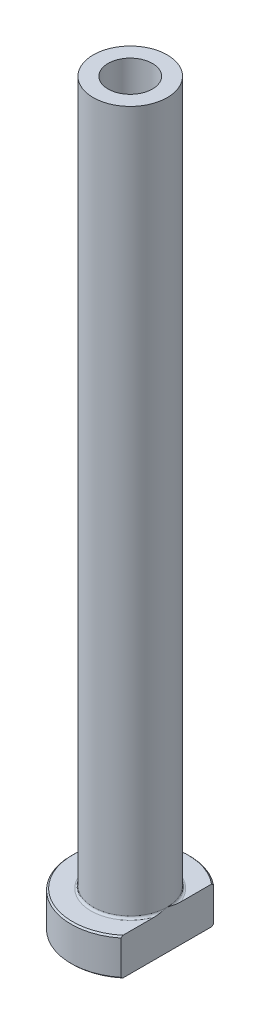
ISO-10303-21;
HEADER;
FILE_DESCRIPTION(('STEP AP214'),'2;1');
FILE_NAME('part.step','',(''),(''),'','','');
FILE_SCHEMA(('AUTOMOTIVE_DESIGN { 1 0 10303 214 1 1 1 1 }'));
ENDSEC;
DATA;
#1=APPLICATION_CONTEXT('core data for automotive mechanical design processes');
#2=APPLICATION_PROTOCOL_DEFINITION('international standard','automotive_design',2000,#1);
#3=PRODUCT_CONTEXT('',#1,'mechanical');
#4=PRODUCT('Part','Part','',(#3));
#5=PRODUCT_RELATED_PRODUCT_CATEGORY('part','',(#4));
#6=PRODUCT_DEFINITION_FORMATION('','',#4);
#7=PRODUCT_DEFINITION_CONTEXT('part definition',#1,'design');
#8=PRODUCT_DEFINITION('design','',#6,#7);
#9=PRODUCT_DEFINITION_SHAPE('','',#8);
#10=(LENGTH_UNIT() NAMED_UNIT(*) SI_UNIT(.MILLI.,.METRE.));
#11=(NAMED_UNIT(*) PLANE_ANGLE_UNIT() SI_UNIT($,.RADIAN.));
#12=(NAMED_UNIT(*) SI_UNIT($,.STERADIAN.) SOLID_ANGLE_UNIT());
#13=UNCERTAINTY_MEASURE_WITH_UNIT(LENGTH_MEASURE(1.E-05),#10,'distance_accuracy_value','');
#14=(GEOMETRIC_REPRESENTATION_CONTEXT(3) GLOBAL_UNCERTAINTY_ASSIGNED_CONTEXT((#13)) GLOBAL_UNIT_ASSIGNED_CONTEXT((#10,
#11,#12)) REPRESENTATION_CONTEXT('',''));
#15=CARTESIAN_POINT('',(0.,0.,0.));
#16=DIRECTION('',(0.,0.,1.));
#17=DIRECTION('',(1.,0.,0.));
#18=AXIS2_PLACEMENT_3D('',#15,#16,#17);
#19=CARTESIAN_POINT('',(0.,92.1876809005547,0.));
#20=DIRECTION('',(0.,1.,0.));
#21=DIRECTION('',(0.,0.,1.));
#22=AXIS2_PLACEMENT_3D('',#19,#20,#21);
#23=CYLINDRICAL_SURFACE('',#22,2.99999999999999);
#24=CARTESIAN_POINT('',(0.,100.,0.));
#25=DIRECTION('',(0.,1.,0.));
#26=DIRECTION('',(0.,0.,1.));
#27=AXIS2_PLACEMENT_3D('',#24,#25,#26);
#28=CIRCLE('',#27,2.99999999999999);
#29=CARTESIAN_POINT('',(0.,100.,2.99999999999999));
#30=VERTEX_POINT('',#29);
#31=EDGE_CURVE('E167',#30,#30,#28,.T.);
#32=ORIENTED_EDGE('',*,*,#31,.T.);
#33=EDGE_LOOP('',(#32));
#34=FACE_BOUND('',#33,.T.);
#35=CARTESIAN_POINT('',(0.,55.,0.));
#36=DIRECTION('',(0.,1.,0.));
#37=DIRECTION('',(0.,0.,1.));
#38=AXIS2_PLACEMENT_3D('',#35,#36,#37);
#39=CIRCLE('',#38,2.99999999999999);
#40=CARTESIAN_POINT('',(0.,55.,2.99999999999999));
#41=VERTEX_POINT('',#40);
#42=EDGE_CURVE('E170',#41,#41,#39,.T.);
#43=ORIENTED_EDGE('',*,*,#42,.F.);
#44=EDGE_LOOP('',(#43));
#45=FACE_BOUND('',#44,.T.);
#46=ADVANCED_FACE('F32',(#34,#45),#23,.F.);
#47=CARTESIAN_POINT('',(-2.99999999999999,100.,0.));
#48=DIRECTION('',(0.,1.,0.));
#49=DIRECTION('',(0.,0.,1.));
#50=AXIS2_PLACEMENT_3D('',#47,#48,#49);
#51=PLANE('',#50);
#52=CARTESIAN_POINT('',(0.,100.,0.));
#53=DIRECTION('',(0.,1.,0.));
#54=DIRECTION('',(0.,0.,1.));
#55=AXIS2_PLACEMENT_3D('',#52,#53,#54);
#56=CIRCLE('',#55,5.);
#57=CARTESIAN_POINT('',(0.,100.,5.));
#58=VERTEX_POINT('',#57);
#59=EDGE_CURVE('E174',#58,#58,#56,.T.);
#60=ORIENTED_EDGE('',*,*,#59,.T.);
#61=EDGE_LOOP('',(#60));
#62=FACE_BOUND('',#61,.T.);
#63=ORIENTED_EDGE('',*,*,#31,.F.);
#64=EDGE_LOOP('',(#63));
#65=FACE_BOUND('',#64,.T.);
#66=ADVANCED_FACE('F157',(#62,#65),#51,.T.);
#67=CARTESIAN_POINT('',(0.,92.1876809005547,0.));
#68=DIRECTION('',(0.,1.,0.));
#69=DIRECTION('',(0.,0.,1.));
#70=AXIS2_PLACEMENT_3D('',#67,#68,#69);
#71=CYLINDRICAL_SURFACE('',#70,5.);
#72=CARTESIAN_POINT('',(0.,5.3,0.));
#73=DIRECTION('',(0.,1.,0.));
#74=DIRECTION('',(0.,0.,1.));
#75=AXIS2_PLACEMENT_3D('',#72,#73,#74);
#76=CIRCLE('',#75,5.);
#77=CARTESIAN_POINT('',(5.,5.3,0.));
#78=VERTEX_POINT('',#77);
#79=EDGE_CURVE('E180',#78,#78,#76,.T.);
#80=ORIENTED_EDGE('',*,*,#79,.T.);
#81=EDGE_LOOP('',(#80));
#82=FACE_BOUND('',#81,.T.);
#83=ORIENTED_EDGE('',*,*,#59,.F.);
#84=EDGE_LOOP('',(#83));
#85=FACE_BOUND('',#84,.T.);
#86=ADVANCED_FACE('F162',(#82,#85),#71,.T.);
#87=CARTESIAN_POINT('',(-4.99999999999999,5.,0.));
#88=DIRECTION('',(0.,1.,0.));
#89=DIRECTION('',(0.,0.,1.));
#90=AXIS2_PLACEMENT_3D('',#87,#88,#89);
#91=PLANE('',#90);
#92=DIRECTION('',(0.,0.,1.));
#93=VECTOR('',#92,1.);
#94=CARTESIAN_POINT('',(5.,5.,0.));
#95=LINE('',#94,#93);
#96=CARTESIAN_POINT('',(5.,5.,-5.98665181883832));
#97=VERTEX_POINT('',#96);
#98=CARTESIAN_POINT('',(5.,5.,-1.75783958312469));
#99=VERTEX_POINT('',#98);
#100=EDGE_CURVE('E54',#97,#99,#95,.T.);
#101=ORIENTED_EDGE('',*,*,#100,.F.);
#102=CARTESIAN_POINT('',(0.,5.,0.));
#103=DIRECTION('',(0.,1.,0.));
#104=DIRECTION('',(0.,0.,1.));
#105=AXIS2_PLACEMENT_3D('',#102,#103,#104);
#106=CIRCLE('',#105,7.80000000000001);
#107=CARTESIAN_POINT('',(4.99999999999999,5.,5.98665181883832));
#108=VERTEX_POINT('',#107);
#109=EDGE_CURVE('E186',#97,#108,#106,.T.);
#110=ORIENTED_EDGE('',*,*,#109,.T.);
#111=CARTESIAN_POINT('',(5.,5.,1.75783958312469));
#112=VERTEX_POINT('',#111);
#113=EDGE_CURVE('E134',#112,#108,#95,.T.);
#114=ORIENTED_EDGE('',*,*,#113,.F.);
#115=CARTESIAN_POINT('',(0.,5.,0.));
#116=DIRECTION('',(0.,1.,0.));
#117=DIRECTION('',(0.,0.,1.));
#118=AXIS2_PLACEMENT_3D('',#115,#116,#117);
#119=CIRCLE('',#118,5.3);
#120=EDGE_CURVE('E183',#112,#99,#119,.F.);
#121=ORIENTED_EDGE('',*,*,#120,.T.);
#122=EDGE_LOOP('',(#101,#110,#114,#121));
#123=FACE_BOUND('',#122,.T.);
#124=ADVANCED_FACE('F197',(#123),#91,.T.);
#125=CARTESIAN_POINT('',(0.,92.1876809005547,0.));
#126=DIRECTION('',(0.,1.,0.));
#127=DIRECTION('',(0.,0.,1.));
#128=AXIS2_PLACEMENT_3D('',#125,#126,#127);
#129=CYLINDRICAL_SURFACE('',#128,7.99999999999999);
#130=DIRECTION('',(0.,-1.,0.));
#131=VECTOR('',#130,1.);
#132=CARTESIAN_POINT('',(4.99999999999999,100.,6.24499799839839));
#133=LINE('',#132,#131);
#134=CARTESIAN_POINT('',(4.99999999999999,4.80000000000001,6.24499799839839));
#135=VERTEX_POINT('',#134);
#136=CARTESIAN_POINT('',(4.99999999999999,0.200000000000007,6.24499799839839));
#137=VERTEX_POINT('',#136);
#138=EDGE_CURVE('E82',#135,#137,#133,.T.);
#139=ORIENTED_EDGE('',*,*,#138,.F.);
#140=CARTESIAN_POINT('',(0.,4.80000000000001,0.));
#141=DIRECTION('',(0.,1.,0.));
#142=DIRECTION('',(0.,0.,1.));
#143=AXIS2_PLACEMENT_3D('',#140,#141,#142);
#144=CIRCLE('',#143,7.99999999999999);
#145=CARTESIAN_POINT('',(5.,4.80000000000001,-6.24499799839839));
#146=VERTEX_POINT('',#145);
#147=EDGE_CURVE('E95',#135,#146,#144,.F.);
#148=ORIENTED_EDGE('',*,*,#147,.T.);
#149=DIRECTION('',(0.,-1.,0.));
#150=VECTOR('',#149,1.);
#151=CARTESIAN_POINT('',(5.,100.,-6.24499799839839));
#152=LINE('',#151,#150);
#153=CARTESIAN_POINT('',(5.,0.200000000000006,-6.24499799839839));
#154=VERTEX_POINT('',#153);
#155=EDGE_CURVE('E192',#146,#154,#152,.T.);
#156=ORIENTED_EDGE('',*,*,#155,.T.);
#157=CARTESIAN_POINT('',(0.,0.200000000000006,0.));
#158=DIRECTION('',(0.,-1.,0.));
#159=DIRECTION('',(0.,0.,-1.));
#160=AXIS2_PLACEMENT_3D('',#157,#158,#159);
#161=CIRCLE('',#160,7.99999999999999);
#162=EDGE_CURVE('E98',#154,#137,#161,.F.);
#163=ORIENTED_EDGE('',*,*,#162,.T.);
#164=EDGE_LOOP('',(#139,#148,#156,#163));
#165=FACE_BOUND('',#164,.T.);
#166=ADVANCED_FACE('F190',(#165),#129,.T.);
#167=CARTESIAN_POINT('',(-7.99999999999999,0.,0.));
#168=DIRECTION('',(0.,-1.,0.));
#169=DIRECTION('',(0.,0.,-1.));
#170=AXIS2_PLACEMENT_3D('',#167,#168,#169);
#171=PLANE('',#170);
#172=CARTESIAN_POINT('',(0.,0.,0.));
#173=DIRECTION('',(0.,-1.,0.));
#174=DIRECTION('',(0.,0.,-1.));
#175=AXIS2_PLACEMENT_3D('',#172,#173,#174);
#176=CIRCLE('',#175,3.74999999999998);
#177=CARTESIAN_POINT('',(0.,0.,-3.74999999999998));
#178=VERTEX_POINT('',#177);
#179=EDGE_CURVE('E40',#178,#178,#176,.F.);
#180=ORIENTED_EDGE('',*,*,#179,.T.);
#181=EDGE_LOOP('',(#180));
#182=FACE_BOUND('',#181,.T.);
#183=DIRECTION('',(0.,0.,-1.));
#184=VECTOR('',#183,1.);
#185=CARTESIAN_POINT('',(4.99999999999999,0.,6.24499799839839));
#186=LINE('',#185,#184);
#187=CARTESIAN_POINT('',(4.99999999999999,0.,5.9866518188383));
#188=VERTEX_POINT('',#187);
#189=CARTESIAN_POINT('',(5.,0.,-5.98665181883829));
#190=VERTEX_POINT('',#189);
#191=EDGE_CURVE('E47',#188,#190,#186,.T.);
#192=ORIENTED_EDGE('',*,*,#191,.F.);
#193=CARTESIAN_POINT('',(0.,0.,0.));
#194=DIRECTION('',(0.,-1.,0.));
#195=DIRECTION('',(0.,0.,-1.));
#196=AXIS2_PLACEMENT_3D('',#193,#194,#195);
#197=CIRCLE('',#196,7.79999999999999);
#198=EDGE_CURVE('E92',#188,#190,#197,.T.);
#199=ORIENTED_EDGE('',*,*,#198,.T.);
#200=EDGE_LOOP('',(#192,#199));
#201=FACE_BOUND('',#200,.T.);
#202=ADVANCED_FACE('F91',(#182,#201),#171,.T.);
#203=CARTESIAN_POINT('',(0.,92.1876809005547,0.));
#204=DIRECTION('',(0.,1.,0.));
#205=DIRECTION('',(0.,0.,1.));
#206=AXIS2_PLACEMENT_3D('',#203,#204,#205);
#207=CYLINDRICAL_SURFACE('',#206,3.24999999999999);
#208=CARTESIAN_POINT('',(0.,0.499999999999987,0.));
#209=DIRECTION('',(0.,-1.,0.));
#210=DIRECTION('',(0.,0.,-1.));
#211=AXIS2_PLACEMENT_3D('',#208,#209,#210);
#212=CIRCLE('',#211,3.24999999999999);
#213=CARTESIAN_POINT('',(0.,0.499999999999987,-3.24999999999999));
#214=VERTEX_POINT('',#213);
#215=EDGE_CURVE('E11',#214,#214,#212,.T.);
#216=ORIENTED_EDGE('',*,*,#215,.T.);
#217=EDGE_LOOP('',(#216));
#218=FACE_BOUND('',#217,.T.);
#219=CARTESIAN_POINT('',(0.,43.,0.));
#220=DIRECTION('',(0.,1.,0.));
#221=DIRECTION('',(0.,0.,1.));
#222=AXIS2_PLACEMENT_3D('',#219,#220,#221);
#223=CIRCLE('',#222,3.25);
#224=CARTESIAN_POINT('',(0.,43.,3.25));
#225=VERTEX_POINT('',#224);
#226=EDGE_CURVE('E172',#225,#225,#223,.T.);
#227=ORIENTED_EDGE('',*,*,#226,.T.);
#228=EDGE_LOOP('',(#227));
#229=FACE_BOUND('',#228,.T.);
#230=ADVANCED_FACE('F215',(#218,#229),#207,.F.);
#231=CARTESIAN_POINT('',(0.,43.,0.));
#232=DIRECTION('',(0.,-1.,0.));
#233=DIRECTION('',(0.,0.,-1.));
#234=AXIS2_PLACEMENT_3D('',#231,#232,#233);
#235=CONICAL_SURFACE('',#234,3.25,0.0208303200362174);
#236=ORIENTED_EDGE('',*,*,#42,.T.);
#237=EDGE_LOOP('',(#236));
#238=FACE_BOUND('',#237,.T.);
#239=ORIENTED_EDGE('',*,*,#226,.F.);
#240=EDGE_LOOP('',(#239));
#241=FACE_BOUND('',#240,.T.);
#242=ADVANCED_FACE('F111',(#238,#241),#235,.F.);
#243=CARTESIAN_POINT('',(0.,5.3,0.));
#244=DIRECTION('',(0.,1.,0.));
#245=DIRECTION('',(0.,0.,1.));
#246=AXIS2_PLACEMENT_3D('',#243,#244,#245);
#247=TOROIDAL_SURFACE('',#246,5.3,0.3);
#248=ORIENTED_EDGE('',*,*,#120,.F.);
#249=CARTESIAN_POINT('',(5.,5.3,0.));
#250=CARTESIAN_POINT('',(5.,5.30000062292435,-1.31469035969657E-10));
#251=CARTESIAN_POINT('',(5.,5.30000124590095,2.52759224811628E-07));
#252=CARTESIAN_POINT('',(5.,5.30000240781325,9.47164356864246E-07));
#253=CARTESIAN_POINT('',(5.,5.30000293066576,1.40594039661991E-06));
#254=CARTESIAN_POINT('',(5.,5.30000402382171,2.50637608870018E-06));
#255=CARTESIAN_POINT('',(5.,5.30000457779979,3.1658891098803E-06));
#256=CARTESIAN_POINT('',(5.,5.30000556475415,4.52859968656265E-06));
#257=CARTESIAN_POINT('',(5.,5.30000600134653,5.22939450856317E-06));
#258=CARTESIAN_POINT('',(5.,5.30000763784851,7.96121989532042E-06));
#259=CARTESIAN_POINT('',(5.,5.30000875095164,1.00477409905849E-05));
#260=CARTESIAN_POINT('',(5.,5.30001056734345,1.41660874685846E-05));
#261=CARTESIAN_POINT('',(5.,5.30001129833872,1.61861784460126E-05));
#262=CARTESIAN_POINT('',(5.,5.3000143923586,2.47865742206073E-05));
#263=CARTESIAN_POINT('',(5.,5.30001672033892,3.13830284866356E-05));
#264=CARTESIAN_POINT('',(5.,5.3000201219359,4.38084221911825E-05));
#265=CARTESIAN_POINT('',(5.,5.30002133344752,4.95992740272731E-05));
#266=CARTESIAN_POINT('',(5.,5.30003020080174,9.27862615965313E-05));
#267=CARTESIAN_POINT('',(5.,5.30003696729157,0.000130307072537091));
#268=CARTESIAN_POINT('',(5.,5.30006659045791,0.000278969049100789));
#269=CARTESIAN_POINT('',(5.,5.30009481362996,0.000389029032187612));
#270=CARTESIAN_POINT('',(5.,5.30020506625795,0.000826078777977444));
#271=CARTESIAN_POINT('',(5.,5.30028365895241,0.00115365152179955));
#272=CARTESIAN_POINT('',(5.,5.30059919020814,0.00245925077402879));
#273=CARTESIAN_POINT('',(5.,5.3008404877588,0.00343651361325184));
#274=CARTESIAN_POINT('',(5.,5.30184626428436,0.00752058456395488));
#275=CARTESIAN_POINT('',(5.,5.30260525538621,0.0106283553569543));
#276=CARTESIAN_POINT('',(5.,5.30996461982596,0.0407482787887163));
#277=CARTESIAN_POINT('',(5.,5.3165898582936,0.0677561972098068));
#278=CARTESIAN_POINT('',(5.,5.32953319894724,0.120688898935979));
#279=CARTESIAN_POINT('',(5.,5.33585289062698,0.146613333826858));
#280=CARTESIAN_POINT('',(5.,5.34926050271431,0.201795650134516));
#281=CARTESIAN_POINT('',(5.,5.35634306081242,0.231054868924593));
#282=CARTESIAN_POINT('',(5.,5.37050252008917,0.289917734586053));
#283=CARTESIAN_POINT('',(5.,5.37757848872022,0.319521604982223));
#284=CARTESIAN_POINT('',(5.,5.39452602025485,0.391032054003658));
#285=CARTESIAN_POINT('',(5.,5.40434071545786,0.432952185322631));
#286=CARTESIAN_POINT('',(5.,5.42340141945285,0.515763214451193));
#287=CARTESIAN_POINT('',(5.,5.4326555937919,0.556652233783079));
#288=CARTESIAN_POINT('',(5.,5.4571055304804,0.667075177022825));
#289=CARTESIAN_POINT('',(5.,5.47194176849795,0.736689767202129));
#290=CARTESIAN_POINT('',(5.,5.50018229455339,0.876836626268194));
#291=CARTESIAN_POINT('',(5.,5.51357312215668,0.947371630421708));
#292=CARTESIAN_POINT('',(5.,5.5393092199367,1.09497328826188));
#293=CARTESIAN_POINT('',(5.,5.5514621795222,1.17207432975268));
#294=CARTESIAN_POINT('',(5.,5.57239669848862,1.32672649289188));
#295=CARTESIAN_POINT('',(5.,5.58117877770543,1.40427754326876));
#296=CARTESIAN_POINT('',(5.,5.59499725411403,1.56873827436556));
#297=CARTESIAN_POINT('',(5.,5.59948802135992,1.65570044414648));
#298=CARTESIAN_POINT('',(5.,5.60018885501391,1.78535304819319));
#299=CARTESIAN_POINT('',(5.,5.59945214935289,1.82802575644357));
#300=CARTESIAN_POINT('',(5.,5.59559364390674,1.91325081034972));
#301=CARTESIAN_POINT('',(5.,5.59247319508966,1.95580321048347));
#302=CARTESIAN_POINT('',(5.,5.58383242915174,2.03512365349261));
#303=CARTESIAN_POINT('',(5.,5.57867386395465,2.07192937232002));
#304=CARTESIAN_POINT('',(5.,5.56543793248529,2.14526756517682));
#305=CARTESIAN_POINT('',(5.,5.55734203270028,2.18179676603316));
#306=CARTESIAN_POINT('',(5.,5.53718005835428,2.25427226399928));
#307=CARTESIAN_POINT('',(5.,5.52507057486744,2.29020746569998));
#308=CARTESIAN_POINT('',(5.,5.50270928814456,2.34223029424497));
#309=CARTESIAN_POINT('',(5.,5.4945781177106,2.35922314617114));
#310=CARTESIAN_POINT('',(5.,5.47657809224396,2.39224900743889));
#311=CARTESIAN_POINT('',(5.,5.46671281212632,2.40828390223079));
#312=CARTESIAN_POINT('',(5.,5.446958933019,2.43579467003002));
#313=CARTESIAN_POINT('',(5.,5.43745879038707,2.4475459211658));
#314=CARTESIAN_POINT('',(5.,5.41677914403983,2.46946476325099));
#315=CARTESIAN_POINT('',(5.,5.40560543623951,2.47963758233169));
#316=CARTESIAN_POINT('',(5.,5.38617750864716,2.49393642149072));
#317=CARTESIAN_POINT('',(5.,5.37851643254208,2.49886271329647));
#318=CARTESIAN_POINT('',(5.,5.36252740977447,2.50749953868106));
#319=CARTESIAN_POINT('',(5.,5.35419984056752,2.51121075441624));
#320=CARTESIAN_POINT('',(5.,5.33690648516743,2.51712941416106));
#321=CARTESIAN_POINT('',(5.,5.32793451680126,2.5193192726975));
#322=CARTESIAN_POINT('',(5.,5.30973576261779,2.52185978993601));
#323=CARTESIAN_POINT('',(5.,5.30050931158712,2.52221275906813));
#324=CARTESIAN_POINT('',(5.,5.28349166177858,2.52112455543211));
#325=CARTESIAN_POINT('',(5.,5.27568322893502,2.51993178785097));
#326=CARTESIAN_POINT('',(5.,5.26036860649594,2.51628294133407));
#327=CARTESIAN_POINT('',(5.,5.25286261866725,2.5138260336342));
#328=CARTESIAN_POINT('',(5.,5.23590266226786,2.50685484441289));
#329=CARTESIAN_POINT('',(5.,5.22661875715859,2.5019298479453));
#330=CARTESIAN_POINT('',(5.,5.2089551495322,2.49066548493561));
#331=CARTESIAN_POINT('',(5.,5.20057756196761,2.4843229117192));
#332=CARTESIAN_POINT('',(5.,5.17987008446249,2.46645212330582));
#333=CARTESIAN_POINT('',(5.,5.16824151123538,2.45411867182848));
#334=CARTESIAN_POINT('',(5.,5.14692461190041,2.42790849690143));
#335=CARTESIAN_POINT('',(5.,5.13723987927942,2.41402898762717));
#336=CARTESIAN_POINT('',(5.,5.11080706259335,2.37143175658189));
#337=CARTESIAN_POINT('',(5.,5.09628770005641,2.34134703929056));
#338=CARTESIAN_POINT('',(5.,5.07130349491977,2.27940731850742));
#339=CARTESIAN_POINT('',(5.,5.06087110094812,2.24754035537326));
#340=CARTESIAN_POINT('',(5.,5.03890359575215,2.1678724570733));
#341=CARTESIAN_POINT('',(5.,5.0291352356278,2.11959065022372));
#342=CARTESIAN_POINT('',(5.,5.01416953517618,2.02224928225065));
#343=CARTESIAN_POINT('',(5.,5.00898637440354,1.97318778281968));
#344=CARTESIAN_POINT('',(5.,5.00220823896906,1.87635767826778));
#345=CARTESIAN_POINT('',(5.,5.00050709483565,1.82859609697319));
#346=CARTESIAN_POINT('',(5.,4.99969104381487,1.7333016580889));
#347=CARTESIAN_POINT('',(5.,5.00056327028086,1.68576884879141));
#348=CARTESIAN_POINT('',(5.,5.00484296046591,1.57937770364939));
#349=CARTESIAN_POINT('',(5.,5.00880932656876,1.52054285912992));
#350=CARTESIAN_POINT('',(5.,5.01925964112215,1.40312974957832));
#351=CARTESIAN_POINT('',(5.,5.02574264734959,1.34455139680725));
#352=CARTESIAN_POINT('',(5.,5.04090087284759,1.22627662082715));
#353=CARTESIAN_POINT('',(5.,5.04962425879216,1.16658647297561));
#354=CARTESIAN_POINT('',(5.,5.06877923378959,1.04732463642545));
#355=CARTESIAN_POINT('',(5.,5.07921523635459,0.987753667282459));
#356=CARTESIAN_POINT('',(5.,5.10551698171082,0.846936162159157));
#357=CARTESIAN_POINT('',(5.,5.12196565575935,0.765799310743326));
#358=CARTESIAN_POINT('',(5.,5.15639716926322,0.604819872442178));
#359=CARTESIAN_POINT('',(5.,5.17436050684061,0.524973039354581));
#360=CARTESIAN_POINT('',(5.,5.20921667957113,0.374726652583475));
#361=CARTESIAN_POINT('',(5.,5.22599388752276,0.304300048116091));
#362=CARTESIAN_POINT('',(5.,5.25191105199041,0.196907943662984));
#363=CARTESIAN_POINT('',(5.,5.26090146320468,0.159905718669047));
#364=CARTESIAN_POINT('',(5.,5.2788185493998,0.0865164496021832));
#365=CARTESIAN_POINT('',(5.,5.28774391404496,0.0501291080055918));
#366=CARTESIAN_POINT('',(5.,5.2973962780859,0.0106218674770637));
#367=CARTESIAN_POINT('',(5.,5.29815688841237,0.00750762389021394));
#368=CARTESIAN_POINT('',(5.,5.29916304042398,0.0034220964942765));
#369=CARTESIAN_POINT('',(5.,5.29940309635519,0.00244985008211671));
#370=CARTESIAN_POINT('',(5.,5.29971711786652,0.00115049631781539));
#371=CARTESIAN_POINT('',(5.,5.29979541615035,0.000824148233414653));
#372=CARTESIAN_POINT('',(5.,5.29990531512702,0.000388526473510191));
#373=CARTESIAN_POINT('',(5.,5.29993348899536,0.000278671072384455));
#374=CARTESIAN_POINT('',(5.,5.29996306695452,0.000130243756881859));
#375=CARTESIAN_POINT('',(5.,5.29996982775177,9.27511380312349E-05));
#376=CARTESIAN_POINT('',(5.,5.29997868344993,4.95929890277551E-05));
#377=CARTESIAN_POINT('',(5.,5.29997989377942,4.38036556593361E-05));
#378=CARTESIAN_POINT('',(5.,5.29998329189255,3.13814186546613E-05));
#379=CARTESIAN_POINT('',(5.,5.29998561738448,2.47865220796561E-05));
#380=CARTESIAN_POINT('',(5.,5.29998870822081,1.61877547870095E-05));
#381=CARTESIAN_POINT('',(5.,5.29998943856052,1.416777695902E-05));
#382=CARTESIAN_POINT('',(5.,5.29999125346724,1.00495531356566E-05));
#383=CARTESIAN_POINT('',(5.,5.29999236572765,7.96302663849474E-06));
#384=CARTESIAN_POINT('',(5.,5.29999400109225,5.23107421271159E-06));
#385=CARTESIAN_POINT('',(5.,5.29999443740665,4.53021037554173E-06));
#386=CARTESIAN_POINT('',(5.,5.29999542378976,3.16731158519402E-06));
#387=CARTESIAN_POINT('',(5.,5.2999959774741,2.5076772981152E-06));
#388=CARTESIAN_POINT('',(5.,5.29999707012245,1.40695881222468E-06));
#389=CARTESIAN_POINT('',(5.,5.2999975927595,9.48032462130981E-07));
#390=CARTESIAN_POINT('',(5.,5.29999875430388,2.53244333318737E-07));
#391=CARTESIAN_POINT('',(5.,5.29999937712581,1.31459837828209E-10));
#392=CARTESIAN_POINT('',(5.,5.3,0.));
#393=B_SPLINE_CURVE_WITH_KNOTS('',3,(#249,#250,#251,#252,#253,#254,#255,#256,#257,#258,#259,
#260,#261,#262,#263,#264,#265,#266,#267,#268,#269,#270,#271,#272,#273,#274,#275,#276,#277,#278,
#279,#280,#281,#282,#283,#284,#285,#286,#287,#288,#289,#290,#291,#292,#293,#294,#295,#296,#297,
#298,#299,#300,#301,#302,#303,#304,#305,#306,#307,#308,#309,#310,#311,#312,#313,#314,#315,#316,
#317,#318,#319,#320,#321,#322,#323,#324,#325,#326,#327,#328,#329,#330,#331,#332,#333,#334,#335,
#336,#337,#338,#339,#340,#341,#342,#343,#344,#345,#346,#347,#348,#349,#350,#351,#352,#353,#354,
#355,#356,#357,#358,#359,#360,#361,#362,#363,#364,#365,#366,#367,#368,#369,#370,#371,#372,#373,
#374,#375,#376,#377,#378,#379,#380,#381,#382,#383,#384,#385,#386,#387,#388,#389,#390,#391,#392),
.UNSPECIFIED.,.T.,.F.,(4,2,2,2,2,2,2,2,2,2,2,2,2,2,2,2,2,2,2,2,2,2,2,2,2,2,2,2,2,2,2,2,2,2,2,2,
2,2,2,2,2,2,2,2,2,2,2,2,2,2,2,2,2,2,2,2,2,2,2,2,2,2,2,2,2,2,2,2,2,2,2,4),(0.,
1.88939299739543E-06,3.98058885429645E-06,6.54818524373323E-06,9.02404341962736E-06,
1.6093874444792E-05,2.25328191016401E-05,4.34843914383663E-05,6.12120190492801E-05,
0.00017562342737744,0.000516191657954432,0.00152710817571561,0.00454656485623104,
0.0141443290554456,0.0975679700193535,0.177619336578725,0.267931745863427,0.359245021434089,
0.488405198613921,0.61417378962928,0.827694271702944,1.04305715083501,1.27715608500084,
1.51121890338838,1.77214751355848,1.90013509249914,2.02805018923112,2.13945459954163,
2.25157451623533,2.36494894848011,2.42139235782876,2.4777207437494,2.52293802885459,
2.56800219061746,2.59524342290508,2.62246933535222,2.65000494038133,2.67750590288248,
2.7010894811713,2.72468854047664,2.75603978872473,2.78746268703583,2.83802806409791,
2.88868607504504,2.98834295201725,3.08877575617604,3.23618650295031,3.38405153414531,
3.52733651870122,3.66990630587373,3.84673903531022,4.02350562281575,4.20444776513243,
4.38586374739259,4.63419556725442,4.87971270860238,5.09690175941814,5.2111388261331,
5.32353360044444,5.3331513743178,5.33615533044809,5.33716246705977,5.33750240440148,
5.33761672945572,5.33763445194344,5.33765539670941,5.33766183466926,5.33766890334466,
5.33767137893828,5.33767394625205,5.33767603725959,5.33767792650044),.UNSPECIFIED.);
#394=EDGE_CURVE('E126',#112,#78,#393,.T.);
#395=ORIENTED_EDGE('',*,*,#394,.T.);
#396=ORIENTED_EDGE('',*,*,#79,.F.);
#397=CARTESIAN_POINT('',(5.,5.3,0.));
#398=CARTESIAN_POINT('',(5.,5.29999937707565,1.31470316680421E-10));
#399=CARTESIAN_POINT('',(5.,5.29999875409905,-2.52759223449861E-07));
#400=CARTESIAN_POINT('',(5.,5.29999759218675,-9.47164355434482E-07));
#401=CARTESIAN_POINT('',(5.,5.29999706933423,-1.4059403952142E-06));
#402=CARTESIAN_POINT('',(5.,5.29999597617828,-2.50637608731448E-06));
#403=CARTESIAN_POINT('',(5.,5.29999542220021,-3.16588910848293E-06));
#404=CARTESIAN_POINT('',(5.,5.29999443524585,-4.52859968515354E-06));
#405=CARTESIAN_POINT('',(5.,5.29999399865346,-5.22939450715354E-06));
#406=CARTESIAN_POINT('',(5.,5.29999236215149,-7.96121989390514E-06));
#407=CARTESIAN_POINT('',(5.,5.29999124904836,-1.00477409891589E-05));
#408=CARTESIAN_POINT('',(5.,5.29998943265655,-1.41660874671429E-05));
#409=CARTESIAN_POINT('',(5.,5.29998870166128,-1.61861784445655E-05));
#410=CARTESIAN_POINT('',(5.,5.2999856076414,-2.47865742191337E-05));
#411=CARTESIAN_POINT('',(5.,5.29998327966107,-3.1383028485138E-05));
#412=CARTESIAN_POINT('',(5.,5.2999798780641,-4.38084221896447E-05));
#413=CARTESIAN_POINT('',(5.,5.29997866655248,-4.95992740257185E-05));
#414=CARTESIAN_POINT('',(5.,5.29996979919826,-9.27862615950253E-05));
#415=CARTESIAN_POINT('',(5.,5.29996303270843,-0.000130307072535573));
#416=CARTESIAN_POINT('',(5.,5.29993340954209,-0.000278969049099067));
#417=CARTESIAN_POINT('',(5.,5.29990518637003,-0.000389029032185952));
#418=CARTESIAN_POINT('',(5.,5.29979493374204,-0.000826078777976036));
#419=CARTESIAN_POINT('',(5.,5.29971634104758,-0.00115365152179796));
#420=CARTESIAN_POINT('',(5.,5.29940080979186,-0.00245925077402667));
#421=CARTESIAN_POINT('',(5.,5.29915951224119,-0.0034365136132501));
#422=CARTESIAN_POINT('',(5.,5.29815373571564,-0.00752058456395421));
#423=CARTESIAN_POINT('',(5.,5.29739474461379,-0.0106283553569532));
#424=CARTESIAN_POINT('',(5.,5.29003538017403,-0.0407482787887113));
#425=CARTESIAN_POINT('',(5.,5.2834101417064,-0.0677561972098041));
#426=CARTESIAN_POINT('',(5.,5.27046680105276,-0.120688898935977));
#427=CARTESIAN_POINT('',(5.,5.26414710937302,-0.146613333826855));
#428=CARTESIAN_POINT('',(5.,5.25073949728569,-0.201795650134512));
#429=CARTESIAN_POINT('',(5.,5.24365693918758,-0.23105486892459));
#430=CARTESIAN_POINT('',(5.,5.22949747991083,-0.28991773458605));
#431=CARTESIAN_POINT('',(5.,5.22242151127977,-0.319521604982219));
#432=CARTESIAN_POINT('',(5.,5.20547397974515,-0.391032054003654));
#433=CARTESIAN_POINT('',(5.,5.19565928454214,-0.432952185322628));
#434=CARTESIAN_POINT('',(5.,5.17659858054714,-0.515763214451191));
#435=CARTESIAN_POINT('',(5.,5.1673444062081,-0.556652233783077));
#436=CARTESIAN_POINT('',(5.,5.1428944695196,-0.667075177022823));
#437=CARTESIAN_POINT('',(5.,5.12805823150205,-0.736689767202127));
#438=CARTESIAN_POINT('',(5.,5.09981770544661,-0.876836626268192));
#439=CARTESIAN_POINT('',(5.,5.08642687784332,-0.947371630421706));
#440=CARTESIAN_POINT('',(5.,5.0606907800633,-1.09497328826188));
#441=CARTESIAN_POINT('',(5.,5.04853782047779,-1.17207432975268));
#442=CARTESIAN_POINT('',(5.,5.02760330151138,-1.32672649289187));
#443=CARTESIAN_POINT('',(5.,5.01882122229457,-1.40427754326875));
#444=CARTESIAN_POINT('',(5.,5.00500274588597,-1.56873827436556));
#445=CARTESIAN_POINT('',(5.,5.00051197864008,-1.65570044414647));
#446=CARTESIAN_POINT('',(5.,4.99981114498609,-1.78535304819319));
#447=CARTESIAN_POINT('',(5.,5.0005478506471,-1.82802575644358));
#448=CARTESIAN_POINT('',(5.,5.00440635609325,-1.91325081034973));
#449=CARTESIAN_POINT('',(5.,5.00752680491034,-1.95580321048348));
#450=CARTESIAN_POINT('',(5.,5.01616757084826,-2.03512365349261));
#451=CARTESIAN_POINT('',(5.,5.02132613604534,-2.07192937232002));
#452=CARTESIAN_POINT('',(5.,5.0345620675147,-2.14526756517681));
#453=CARTESIAN_POINT('',(5.,5.04265796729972,-2.18179676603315));
#454=CARTESIAN_POINT('',(5.,5.06281994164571,-2.25427226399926));
#455=CARTESIAN_POINT('',(5.,5.07492942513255,-2.29020746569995));
#456=CARTESIAN_POINT('',(5.,5.09729071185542,-2.34223029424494));
#457=CARTESIAN_POINT('',(5.,5.10542188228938,-2.3592231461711));
#458=CARTESIAN_POINT('',(5.,5.12342190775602,-2.39224900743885));
#459=CARTESIAN_POINT('',(5.,5.13328718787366,-2.40828390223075));
#460=CARTESIAN_POINT('',(5.,5.15304106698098,-2.43579467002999));
#461=CARTESIAN_POINT('',(5.,5.1625412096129,-2.44754592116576));
#462=CARTESIAN_POINT('',(5.,5.18322085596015,-2.46946476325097));
#463=CARTESIAN_POINT('',(5.,5.19439456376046,-2.47963758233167));
#464=CARTESIAN_POINT('',(5.,5.21382249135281,-2.4939364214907));
#465=CARTESIAN_POINT('',(5.,5.2214835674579,-2.49886271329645));
#466=CARTESIAN_POINT('',(5.,5.2374725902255,-2.50749953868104));
#467=CARTESIAN_POINT('',(5.,5.24580015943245,-2.51121075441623));
#468=CARTESIAN_POINT('',(5.,5.26309351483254,-2.51712941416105));
#469=CARTESIAN_POINT('',(5.,5.27206548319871,-2.5193192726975));
#470=CARTESIAN_POINT('',(5.,5.29026423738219,-2.52185978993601));
#471=CARTESIAN_POINT('',(5.,5.29949068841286,-2.52221275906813));
#472=CARTESIAN_POINT('',(5.,5.3165083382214,-2.52112455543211));
#473=CARTESIAN_POINT('',(5.,5.32431677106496,-2.51993178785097));
#474=CARTESIAN_POINT('',(5.,5.33963139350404,-2.51628294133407));
#475=CARTESIAN_POINT('',(5.,5.34713738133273,-2.51382603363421));
#476=CARTESIAN_POINT('',(5.,5.36409733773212,-2.5068548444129));
#477=CARTESIAN_POINT('',(5.,5.37338124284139,-2.50192984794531));
#478=CARTESIAN_POINT('',(5.,5.39104485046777,-2.49066548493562));
#479=CARTESIAN_POINT('',(5.,5.39942243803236,-2.48432291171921));
#480=CARTESIAN_POINT('',(5.,5.42012991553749,-2.46645212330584));
#481=CARTESIAN_POINT('',(5.,5.4317584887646,-2.45411867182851));
#482=CARTESIAN_POINT('',(5.,5.45307538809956,-2.42790849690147));
#483=CARTESIAN_POINT('',(5.,5.46276012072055,-2.4140289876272));
#484=CARTESIAN_POINT('',(5.,5.48919293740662,-2.37143175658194));
#485=CARTESIAN_POINT('',(5.,5.50371229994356,-2.34134703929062));
#486=CARTESIAN_POINT('',(5.,5.5286965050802,-2.2794073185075));
#487=CARTESIAN_POINT('',(5.,5.53912889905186,-2.24754035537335));
#488=CARTESIAN_POINT('',(5.,5.56109640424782,-2.16787245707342));
#489=CARTESIAN_POINT('',(5.,5.57086476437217,-2.11959065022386));
#490=CARTESIAN_POINT('',(5.,5.5858304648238,-2.02224928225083));
#491=CARTESIAN_POINT('',(5.,5.59101362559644,-1.97318778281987));
#492=CARTESIAN_POINT('',(5.,5.59779176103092,-1.876357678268));
#493=CARTESIAN_POINT('',(5.,5.59949290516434,-1.82859609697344));
#494=CARTESIAN_POINT('',(5.,5.60030895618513,-1.73330165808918));
#495=CARTESIAN_POINT('',(5.,5.59943672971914,-1.68576884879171));
#496=CARTESIAN_POINT('',(5.,5.5951570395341,-1.57937770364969));
#497=CARTESIAN_POINT('',(5.,5.59119067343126,-1.52054285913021));
#498=CARTESIAN_POINT('',(5.,5.58074035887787,-1.40312974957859));
#499=CARTESIAN_POINT('',(5.,5.57425735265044,-1.3445513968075));
#500=CARTESIAN_POINT('',(5.,5.55909912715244,-1.22627662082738));
#501=CARTESIAN_POINT('',(5.,5.55037574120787,-1.16658647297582));
#502=CARTESIAN_POINT('',(5.,5.53122076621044,-1.04732463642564));
#503=CARTESIAN_POINT('',(5.,5.52078476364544,-0.987753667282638));
#504=CARTESIAN_POINT('',(5.,5.4944830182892,-0.846936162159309));
#505=CARTESIAN_POINT('',(5.,5.47803434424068,-0.765799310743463));
#506=CARTESIAN_POINT('',(5.,5.4436028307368,-0.604819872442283));
#507=CARTESIAN_POINT('',(5.,5.42563949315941,-0.524973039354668));
#508=CARTESIAN_POINT('',(5.,5.39078332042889,-0.374726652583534));
#509=CARTESIAN_POINT('',(5.,5.37400611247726,-0.304300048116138));
#510=CARTESIAN_POINT('',(5.,5.34808894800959,-0.196907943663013));
#511=CARTESIAN_POINT('',(5.,5.33909853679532,-0.15990571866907));
#512=CARTESIAN_POINT('',(5.,5.32118145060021,-0.0865164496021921));
#513=CARTESIAN_POINT('',(5.,5.31225608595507,-0.0501291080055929));
#514=CARTESIAN_POINT('',(5.,5.3026037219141,-0.0106218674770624));
#515=CARTESIAN_POINT('',(5.,5.30184311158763,-0.00750762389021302));
#516=CARTESIAN_POINT('',(5.,5.30083695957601,-0.003422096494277));
#517=CARTESIAN_POINT('',(5.,5.30059690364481,-0.00244985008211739));
#518=CARTESIAN_POINT('',(5.,5.30028288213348,-0.00115049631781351));
#519=CARTESIAN_POINT('',(5.,5.30020458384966,-0.000824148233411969));
#520=CARTESIAN_POINT('',(5.,5.30009468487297,-0.000388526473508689));
#521=CARTESIAN_POINT('',(5.,5.30006651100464,-0.000278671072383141));
#522=CARTESIAN_POINT('',(5.,5.30003693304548,-0.000130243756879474));
#523=CARTESIAN_POINT('',(5.,5.30003017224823,-9.27511380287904E-05));
#524=CARTESIAN_POINT('',(5.,5.30002131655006,-4.95929890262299E-05));
#525=CARTESIAN_POINT('',(5.,5.30002010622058,-4.38036556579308E-05));
#526=CARTESIAN_POINT('',(5.,5.30001670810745,-3.13814186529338E-05));
#527=CARTESIAN_POINT('',(5.,5.30001438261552,-2.47865220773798E-05));
#528=CARTESIAN_POINT('',(5.,5.30001129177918,-1.6187754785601E-05));
#529=CARTESIAN_POINT('',(5.,5.30001056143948,-1.41677769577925E-05));
#530=CARTESIAN_POINT('',(5.,5.30000874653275,-1.00495531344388E-05));
#531=CARTESIAN_POINT('',(5.,5.30000763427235,-7.96302663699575E-06));
#532=CARTESIAN_POINT('',(5.,5.30000599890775,-5.23107421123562E-06));
#533=CARTESIAN_POINT('',(5.,5.30000556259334,-4.53021037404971E-06));
#534=CARTESIAN_POINT('',(5.,5.30000457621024,-3.16731158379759E-06));
#535=CARTESIAN_POINT('',(5.,5.30000402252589,-2.50767729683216E-06));
#536=CARTESIAN_POINT('',(5.,5.30000292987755,-1.406958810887E-06));
#537=CARTESIAN_POINT('',(5.,5.3000024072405,-9.48032460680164E-07));
#538=CARTESIAN_POINT('',(5.,5.30000124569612,-2.53244331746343E-07));
#539=CARTESIAN_POINT('',(5.,5.30000062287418,-1.3145834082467E-10));
#540=CARTESIAN_POINT('',(5.,5.3,0.));
#541=B_SPLINE_CURVE_WITH_KNOTS('',3,(#397,#398,#399,#400,#401,#402,#403,#404,#405,#406,#407,
#408,#409,#410,#411,#412,#413,#414,#415,#416,#417,#418,#419,#420,#421,#422,#423,#424,#425,#426,
#427,#428,#429,#430,#431,#432,#433,#434,#435,#436,#437,#438,#439,#440,#441,#442,#443,#444,#445,
#446,#447,#448,#449,#450,#451,#452,#453,#454,#455,#456,#457,#458,#459,#460,#461,#462,#463,#464,
#465,#466,#467,#468,#469,#470,#471,#472,#473,#474,#475,#476,#477,#478,#479,#480,#481,#482,#483,
#484,#485,#486,#487,#488,#489,#490,#491,#492,#493,#494,#495,#496,#497,#498,#499,#500,#501,#502,
#503,#504,#505,#506,#507,#508,#509,#510,#511,#512,#513,#514,#515,#516,#517,#518,#519,#520,#521,
#522,#523,#524,#525,#526,#527,#528,#529,#530,#531,#532,#533,#534,#535,#536,#537,#538,#539,#540),
.UNSPECIFIED.,.T.,.F.,(4,2,2,2,2,2,2,2,2,2,2,2,2,2,2,2,2,2,2,2,2,2,2,2,2,2,2,2,2,2,2,2,2,2,2,2,
2,2,2,2,2,2,2,2,2,2,2,2,2,2,2,2,2,2,2,2,2,2,2,2,2,2,2,2,2,2,2,2,2,2,2,4),(0.,
1.88939299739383E-06,3.9805888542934E-06,6.54818524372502E-06,9.0240434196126E-06,
1.60938744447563E-05,2.25328191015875E-05,4.34843914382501E-05,6.12120190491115E-05,
0.00017562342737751,0.00051619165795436,0.00152710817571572,0.00454656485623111,
0.0141443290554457,0.0975679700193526,0.177619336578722,0.267931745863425,0.359245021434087,
0.48840519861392,0.61417378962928,0.827694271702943,1.04305715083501,1.27715608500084,
1.51121890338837,1.77214751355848,1.90013509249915,2.02805018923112,2.13945459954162,
2.25157451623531,2.36494894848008,2.42139235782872,2.47772074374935,2.52293802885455,
2.56800219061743,2.59524342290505,2.6224693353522,2.65000494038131,2.67750590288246,
2.70108948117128,2.72468854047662,2.75603978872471,2.7874626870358,2.83802806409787,
2.88868607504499,2.98834295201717,3.08877575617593,3.23618650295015,3.38405153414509,
3.52733651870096,3.66990630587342,3.84673903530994,4.0235056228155,4.20444776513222,
4.38586374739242,4.6341955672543,4.8797127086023,5.0969017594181,5.21113882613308,
5.32353360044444,5.3331513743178,5.33615533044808,5.33716246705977,5.33750240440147,
5.33761672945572,5.33763445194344,5.33765539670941,5.33766183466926,5.33766890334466,
5.33767137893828,5.33767394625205,5.33767603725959,5.33767792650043),.UNSPECIFIED.);
#542=EDGE_CURVE('E135',#78,#99,#541,.T.);
#543=ORIENTED_EDGE('',*,*,#542,.T.);
#544=EDGE_LOOP('',(#248,#395,#396,#543));
#545=FACE_BOUND('',#544,.T.);
#546=ADVANCED_FACE('F141',(#545),#247,.F.);
#547=CARTESIAN_POINT('',(0.,5.,0.));
#548=DIRECTION('',(0.,-1.,0.));
#549=DIRECTION('',(0.,0.,-1.));
#550=AXIS2_PLACEMENT_3D('',#547,#548,#549);
#551=CONICAL_SURFACE('',#550,7.8,0.78539816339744);
#552=CARTESIAN_POINT('',(5.,-1.82162423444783,-13.7401563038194));
#553=CARTESIAN_POINT('',(5.,-1.61889813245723,-13.5244204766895));
#554=CARTESIAN_POINT('',(5.,-1.41646387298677,-13.3084101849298));
#555=CARTESIAN_POINT('',(5.,-1.01227657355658,-12.8757508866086));
#556=CARTESIAN_POINT('',(5.,-0.81052353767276,-12.6591018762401));
#557=CARTESIAN_POINT('',(5.,-0.206157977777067,-12.0077661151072));
#558=CARTESIAN_POINT('',(5.,0.195280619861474,-11.5719884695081));
#559=CARTESIAN_POINT('',(5.,1.00388282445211,-10.6856136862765));
#560=CARTESIAN_POINT('',(5.,1.41093902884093,-10.2349182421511));
#561=CARTESIAN_POINT('',(5.,2.01658324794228,-9.55471676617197));
#562=CARTESIAN_POINT('',(5.,2.21758236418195,-9.32735800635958));
#563=CARTESIAN_POINT('',(5.,2.61761142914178,-8.87091599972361));
#564=CARTESIAN_POINT('',(5.,2.81664139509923,-8.64183276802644));
#565=CARTESIAN_POINT('',(5.,3.21217345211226,-8.18170099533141));
#566=CARTESIAN_POINT('',(5.,3.40867681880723,-7.95065355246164));
#567=CARTESIAN_POINT('',(5.,3.79865427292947,-7.4859998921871));
#568=CARTESIAN_POINT('',(5.,3.99212827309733,-7.25239360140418));
#569=CARTESIAN_POINT('',(5.,4.37558160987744,-6.78155890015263));
#570=CARTESIAN_POINT('',(5.,4.56555334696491,-6.54432428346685));
#571=CARTESIAN_POINT('',(5.,4.94042138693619,-6.06589574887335));
#572=CARTESIAN_POINT('',(5.,5.12531810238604,-5.82470215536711));
#573=CARTESIAN_POINT('',(5.,5.48653546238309,-5.33972956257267));
#574=CARTESIAN_POINT('',(5.,5.6629239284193,-5.09600137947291));
#575=CARTESIAN_POINT('',(5.,6.00675382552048,-4.60213647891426));
#576=CARTESIAN_POINT('',(5.,6.17419169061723,-4.35199726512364));
#577=CARTESIAN_POINT('',(5.,6.49592993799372,-3.84445040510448));
#578=CARTESIAN_POINT('',(5.,6.65027272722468,-3.58707012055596));
#579=CARTESIAN_POINT('',(5.,6.86813414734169,-3.19356592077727));
#580=CARTESIAN_POINT('',(5.,6.93845533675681,-3.06120993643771));
#581=CARTESIAN_POINT('',(5.,7.07360441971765,-2.79373319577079));
#582=CARTESIAN_POINT('',(5.,7.13843319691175,-2.65861288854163));
#583=CARTESIAN_POINT('',(5.,7.26869642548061,-2.3693638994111));
#584=CARTESIAN_POINT('',(5.,7.33331212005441,-2.21486278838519));
#585=CARTESIAN_POINT('',(5.,7.45243473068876,-1.9019407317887));
#586=CARTESIAN_POINT('',(5.,7.50694001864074,-1.74351915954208));
#587=CARTESIAN_POINT('',(5.,7.60343746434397,-1.42384276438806));
#588=CARTESIAN_POINT('',(5.,7.64549910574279,-1.26260921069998));
#589=CARTESIAN_POINT('',(5.,7.71543089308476,-0.937062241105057));
#590=CARTESIAN_POINT('',(5.,7.74330266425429,-0.772749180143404));
#591=CARTESIAN_POINT('',(5.,7.78344284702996,-0.439876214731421));
#592=CARTESIAN_POINT('',(5.,7.79548961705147,-0.271289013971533));
#593=CARTESIAN_POINT('',(5.,7.80240809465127,0.066227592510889));
#594=CARTESIAN_POINT('',(5.,7.79728142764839,0.235156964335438));
#595=CARTESIAN_POINT('',(5.,7.77017954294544,0.572209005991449));
#596=CARTESIAN_POINT('',(5.,7.74814735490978,0.740327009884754));
#597=CARTESIAN_POINT('',(5.,7.68863212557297,1.0737984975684));
#598=CARTESIAN_POINT('',(5.,7.65114437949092,1.23915112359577));
#599=CARTESIAN_POINT('',(5.,7.54734433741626,1.62344926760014));
#600=CARTESIAN_POINT('',(5.,7.47553580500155,1.84089917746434));
#601=CARTESIAN_POINT('',(5.,7.31300119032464,2.26856946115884));
#602=CARTESIAN_POINT('',(5.,7.22226460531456,2.47878574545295));
#603=CARTESIAN_POINT('',(5.,7.07492970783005,2.7901406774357));
#604=CARTESIAN_POINT('',(5.,7.02362278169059,2.89384077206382));
#605=CARTESIAN_POINT('',(5.,6.91783840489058,3.09961626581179));
#606=CARTESIAN_POINT('',(4.99999999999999,6.86336091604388,3.20169164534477));
#607=CARTESIAN_POINT('',(4.99999999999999,6.75169048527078,3.40428995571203));
#608=CARTESIAN_POINT('',(4.99999999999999,6.69449856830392,3.50481345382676));
#609=CARTESIAN_POINT('',(4.99999999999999,6.57774196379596,3.70446206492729));
#610=CARTESIAN_POINT('',(4.99999999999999,6.51817739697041,3.80358724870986));
#611=CARTESIAN_POINT('',(4.99999999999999,6.30853654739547,4.14435766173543));
#612=CARTESIAN_POINT('',(4.99999999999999,6.15326588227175,4.38281352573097));
#613=CARTESIAN_POINT('',(4.99999999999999,5.83377190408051,4.85367607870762));
#614=CARTESIAN_POINT('',(4.99999999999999,5.66954595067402,5.08608095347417));
#615=CARTESIAN_POINT('',(4.99999999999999,5.33431698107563,5.54628554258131));
#616=CARTESIAN_POINT('',(4.99999999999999,5.16330740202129,5.77408045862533));
#617=CARTESIAN_POINT('',(4.99999999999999,4.81629923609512,6.22578157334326));
#618=CARTESIAN_POINT('',(4.99999999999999,4.64030119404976,6.44968819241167));
#619=CARTESIAN_POINT('',(4.99999999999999,4.28368615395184,6.8953257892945));
#620=CARTESIAN_POINT('',(4.99999999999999,4.10305289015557,7.11704371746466));
#621=CARTESIAN_POINT('',(4.99999999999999,3.73870710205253,7.55793799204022));
#622=CARTESIAN_POINT('',(4.99999999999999,3.5549945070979,7.77711427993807));
#623=CARTESIAN_POINT('',(4.99999999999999,3.1852108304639,8.21325328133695));
#624=CARTESIAN_POINT('',(4.99999999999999,2.99914113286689,8.43021717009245));
#625=CARTESIAN_POINT('',(4.99999999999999,2.62499812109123,8.86241167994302));
#626=CARTESIAN_POINT('',(4.99999999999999,2.43692478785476,9.0776422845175));
#627=CARTESIAN_POINT('',(4.99999999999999,1.9146340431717,9.67075518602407));
#628=CARTESIAN_POINT('',(4.99999999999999,1.57868086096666,10.0471086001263));
#629=CARTESIAN_POINT('',(4.99999999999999,0.903003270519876,10.7965122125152));
#630=CARTESIAN_POINT('',(4.99999999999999,0.563278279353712,11.169561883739));
#631=CARTESIAN_POINT('',(4.99999999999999,-0.116149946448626,11.9100168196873));
#632=CARTESIAN_POINT('',(4.99999999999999,-0.455830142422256,12.2774432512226));
#633=CARTESIAN_POINT('',(4.99999999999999,-1.13728640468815,13.0102135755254));
#634=CARTESIAN_POINT('',(4.99999999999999,-1.47906204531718,13.3755578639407));
#635=CARTESIAN_POINT('',(4.99999999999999,-1.82162423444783,13.7401563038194));
#636=B_SPLINE_CURVE_WITH_KNOTS('',3,(#552,#553,#554,#555,#556,#557,#558,#559,#560,#561,#562,
#563,#564,#565,#566,#567,#568,#569,#570,#571,#572,#573,#574,#575,#576,#577,#578,#579,#580,#581,
#582,#583,#584,#585,#586,#587,#588,#589,#590,#591,#592,#593,#594,#595,#596,#597,#598,#599,#600,
#601,#602,#603,#604,#605,#606,#607,#608,#609,#610,#611,#612,#613,#614,#615,#616,#617,#618,#619,
#620,#621,#622,#623,#624,#625,#626,#627,#628,#629,#630,#631,#632,#633,#634,#635),.UNSPECIFIED.,
.F.,.F.,(4,2,2,2,2,2,2,2,2,2,2,2,2,2,2,2,2,2,2,2,2,2,2,2,2,2,2,2,2,2,2,2,2,2,2,2,2,2,2,2,2,4),
(0.,0.888120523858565,1.77624635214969,3.55372511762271,5.3755948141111,6.28598924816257,
7.19637570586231,8.10628289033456,9.01621623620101,9.92793449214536,10.8395784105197,
11.7420025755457,12.6447836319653,13.5445196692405,13.9940505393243,14.4435089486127,
14.9456212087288,15.4478142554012,15.9471477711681,16.4464240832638,16.952621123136,
17.458770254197,17.966632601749,18.4746496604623,19.160451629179,19.8466351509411,
20.193687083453,20.5407431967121,20.8876692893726,21.2345777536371,22.087909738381,
22.9414946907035,23.7959266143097,24.6502655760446,25.5081848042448,26.3661237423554,
27.2235803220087,28.0810450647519,29.5944656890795,31.1081235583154,32.60926785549,
34.1101167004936),.UNSPECIFIED.);
#637=EDGE_CURVE('E133',#146,#97,#636,.T.);
#638=ORIENTED_EDGE('',*,*,#637,.F.);
#639=ORIENTED_EDGE('',*,*,#147,.F.);
#640=EDGE_CURVE('E118',#108,#135,#636,.T.);
#641=ORIENTED_EDGE('',*,*,#640,.F.);
#642=ORIENTED_EDGE('',*,*,#109,.F.);
#643=EDGE_LOOP('',(#638,#639,#641,#642));
#644=FACE_BOUND('',#643,.T.);
#645=ADVANCED_FACE('F145',(#644),#551,.T.);
#646=CARTESIAN_POINT('',(0.,0.200000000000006,0.));
#647=DIRECTION('',(0.,1.,0.));
#648=DIRECTION('',(0.,0.,1.));
#649=AXIS2_PLACEMENT_3D('',#646,#647,#648);
#650=CONICAL_SURFACE('',#649,7.99999999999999,0.78539816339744);
#651=CARTESIAN_POINT('',(4.99999999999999,6.82162423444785,13.7401563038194));
#652=CARTESIAN_POINT('',(4.99999999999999,6.61889813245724,13.5244204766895));
#653=CARTESIAN_POINT('',(4.99999999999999,6.41646387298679,13.3084101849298));
#654=CARTESIAN_POINT('',(4.99999999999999,6.0122765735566,12.8757508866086));
#655=CARTESIAN_POINT('',(4.99999999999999,5.81052353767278,12.6591018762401));
#656=CARTESIAN_POINT('',(4.99999999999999,5.20615797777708,12.0077661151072));
#657=CARTESIAN_POINT('',(4.99999999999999,4.80471938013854,11.5719884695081));
#658=CARTESIAN_POINT('',(4.99999999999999,3.9961171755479,10.6856136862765));
#659=CARTESIAN_POINT('',(4.99999999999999,3.58906097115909,10.2349182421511));
#660=CARTESIAN_POINT('',(4.99999999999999,2.98341675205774,9.55471676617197));
#661=CARTESIAN_POINT('',(4.99999999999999,2.78241763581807,9.32735800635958));
#662=CARTESIAN_POINT('',(4.99999999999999,2.38238857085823,8.87091599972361));
#663=CARTESIAN_POINT('',(4.99999999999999,2.18335860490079,8.64183276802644));
#664=CARTESIAN_POINT('',(4.99999999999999,1.78782654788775,8.18170099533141));
#665=CARTESIAN_POINT('',(4.99999999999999,1.59132318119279,7.95065355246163));
#666=CARTESIAN_POINT('',(4.99999999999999,1.20134572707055,7.4859998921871));
#667=CARTESIAN_POINT('',(4.99999999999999,1.00787172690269,7.25239360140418));
#668=CARTESIAN_POINT('',(4.99999999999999,0.624418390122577,6.78155890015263));
#669=CARTESIAN_POINT('',(4.99999999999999,0.434446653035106,6.54432428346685));
#670=CARTESIAN_POINT('',(4.99999999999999,0.0595786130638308,6.06589574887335));
#671=CARTESIAN_POINT('',(4.99999999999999,-0.125318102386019,5.82470215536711));
#672=CARTESIAN_POINT('',(4.99999999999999,-0.486535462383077,5.33972956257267));
#673=CARTESIAN_POINT('',(4.99999999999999,-0.662923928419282,5.09600137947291));
#674=CARTESIAN_POINT('',(4.99999999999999,-1.00675382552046,4.60213647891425));
#675=CARTESIAN_POINT('',(4.99999999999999,-1.17419169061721,4.35199726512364));
#676=CARTESIAN_POINT('',(4.99999999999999,-1.49592993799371,3.84445040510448));
#677=CARTESIAN_POINT('',(4.99999999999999,-1.65027272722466,3.58707012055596));
#678=CARTESIAN_POINT('',(4.99999999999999,-1.86813414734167,3.19356592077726));
#679=CARTESIAN_POINT('',(5.,-1.93845533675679,3.06120993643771));
#680=CARTESIAN_POINT('',(5.,-2.07360441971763,2.79373319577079));
#681=CARTESIAN_POINT('',(5.,-2.13843319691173,2.65861288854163));
#682=CARTESIAN_POINT('',(5.,-2.2686964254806,2.3693638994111));
#683=CARTESIAN_POINT('',(5.,-2.33331212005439,2.21486278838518));
#684=CARTESIAN_POINT('',(5.,-2.45243473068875,1.9019407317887));
#685=CARTESIAN_POINT('',(5.,-2.50694001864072,1.74351915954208));
#686=CARTESIAN_POINT('',(5.,-2.60343746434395,1.42384276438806));
#687=CARTESIAN_POINT('',(5.,-2.64549910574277,1.26260921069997));
#688=CARTESIAN_POINT('',(5.,-2.71543089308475,0.937062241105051));
#689=CARTESIAN_POINT('',(5.,-2.74330266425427,0.772749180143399));
#690=CARTESIAN_POINT('',(5.,-2.78344284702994,0.439876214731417));
#691=CARTESIAN_POINT('',(5.,-2.79548961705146,0.271289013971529));
#692=CARTESIAN_POINT('',(5.,-2.80240809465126,-0.0662275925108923));
#693=CARTESIAN_POINT('',(5.,-2.79728142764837,-0.23515696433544));
#694=CARTESIAN_POINT('',(5.,-2.77017954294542,-0.57220900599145));
#695=CARTESIAN_POINT('',(5.,-2.74814735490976,-0.740327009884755));
#696=CARTESIAN_POINT('',(5.,-2.68863212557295,-1.0737984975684));
#697=CARTESIAN_POINT('',(5.,-2.6511443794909,-1.23915112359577));
#698=CARTESIAN_POINT('',(5.,-2.54734433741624,-1.62344926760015));
#699=CARTESIAN_POINT('',(5.,-2.47553580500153,-1.84089917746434));
#700=CARTESIAN_POINT('',(5.,-2.31300119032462,-2.26856946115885));
#701=CARTESIAN_POINT('',(5.,-2.22226460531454,-2.47878574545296));
#702=CARTESIAN_POINT('',(5.,-2.07492970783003,-2.7901406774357));
#703=CARTESIAN_POINT('',(5.,-2.02362278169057,-2.89384077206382));
#704=CARTESIAN_POINT('',(5.,-1.91783840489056,-3.09961626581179));
#705=CARTESIAN_POINT('',(5.,-1.86336091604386,-3.20169164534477));
#706=CARTESIAN_POINT('',(5.,-1.75169048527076,-3.40428995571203));
#707=CARTESIAN_POINT('',(5.,-1.6944985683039,-3.50481345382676));
#708=CARTESIAN_POINT('',(5.,-1.57774196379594,-3.70446206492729));
#709=CARTESIAN_POINT('',(5.,-1.51817739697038,-3.80358724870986));
#710=CARTESIAN_POINT('',(5.,-1.30853654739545,-4.14435766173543));
#711=CARTESIAN_POINT('',(5.,-1.15326588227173,-4.38281352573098));
#712=CARTESIAN_POINT('',(5.,-0.83377190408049,-4.85367607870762));
#713=CARTESIAN_POINT('',(5.,-0.669545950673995,-5.08608095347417));
#714=CARTESIAN_POINT('',(5.,-0.334316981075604,-5.54628554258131));
#715=CARTESIAN_POINT('',(5.,-0.163307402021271,-5.77408045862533));
#716=CARTESIAN_POINT('',(5.,0.183700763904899,-6.22578157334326));
#717=CARTESIAN_POINT('',(5.,0.359698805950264,-6.44968819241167));
#718=CARTESIAN_POINT('',(5.,0.716313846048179,-6.8953257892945));
#719=CARTESIAN_POINT('',(5.,0.896947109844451,-7.11704371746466));
#720=CARTESIAN_POINT('',(5.,1.26129289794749,-7.55793799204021));
#721=CARTESIAN_POINT('',(5.,1.44500549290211,-7.77711427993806));
#722=CARTESIAN_POINT('',(5.,1.81478916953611,-8.21325328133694));
#723=CARTESIAN_POINT('',(5.,2.00085886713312,-8.43021717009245));
#724=CARTESIAN_POINT('',(5.,2.37500187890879,-8.86241167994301));
#725=CARTESIAN_POINT('',(5.,2.56307521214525,-9.07764228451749));
#726=CARTESIAN_POINT('',(5.,3.08536595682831,-9.67075518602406));
#727=CARTESIAN_POINT('',(5.,3.42131913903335,-10.0471086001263));
#728=CARTESIAN_POINT('',(5.,4.09699672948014,-10.7965122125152));
#729=CARTESIAN_POINT('',(5.,4.4367217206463,-11.169561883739));
#730=CARTESIAN_POINT('',(5.,5.11614994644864,-11.9100168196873));
#731=CARTESIAN_POINT('',(5.,5.45583014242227,-12.2774432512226));
#732=CARTESIAN_POINT('',(5.,6.13728640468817,-13.0102135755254));
#733=CARTESIAN_POINT('',(5.,6.4790620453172,-13.3755578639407));
#734=CARTESIAN_POINT('',(5.,6.82162423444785,-13.7401563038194));
#735=B_SPLINE_CURVE_WITH_KNOTS('',3,(#651,#652,#653,#654,#655,#656,#657,#658,#659,#660,#661,
#662,#663,#664,#665,#666,#667,#668,#669,#670,#671,#672,#673,#674,#675,#676,#677,#678,#679,#680,
#681,#682,#683,#684,#685,#686,#687,#688,#689,#690,#691,#692,#693,#694,#695,#696,#697,#698,#699,
#700,#701,#702,#703,#704,#705,#706,#707,#708,#709,#710,#711,#712,#713,#714,#715,#716,#717,#718,
#719,#720,#721,#722,#723,#724,#725,#726,#727,#728,#729,#730,#731,#732,#733,#734),.UNSPECIFIED.,
.F.,.F.,(4,2,2,2,2,2,2,2,2,2,2,2,2,2,2,2,2,2,2,2,2,2,2,2,2,2,2,2,2,2,2,2,2,2,2,2,2,2,2,2,2,4),
(0.,0.888120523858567,1.77624635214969,3.55372511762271,5.37559481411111,6.28598924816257,
7.19637570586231,8.10628289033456,9.01621623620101,9.92793449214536,10.8395784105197,
11.7420025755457,12.6447836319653,13.5445196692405,13.9940505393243,14.4435089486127,
14.9456212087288,15.4478142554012,15.9471477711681,16.4464240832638,16.952621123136,
17.458770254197,17.9666326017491,18.4746496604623,19.160451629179,19.8466351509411,
20.193687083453,20.5407431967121,20.8876692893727,21.2345777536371,22.087909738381,
22.9414946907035,23.7959266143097,24.6502655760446,25.5081848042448,26.3661237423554,
27.2235803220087,28.0810450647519,29.5944656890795,31.1081235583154,32.60926785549,
34.1101167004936),.UNSPECIFIED.);
#736=EDGE_CURVE('E79',#137,#188,#735,.T.);
#737=ORIENTED_EDGE('',*,*,#736,.F.);
#738=ORIENTED_EDGE('',*,*,#162,.F.);
#739=EDGE_CURVE('E87',#190,#154,#735,.T.);
#740=ORIENTED_EDGE('',*,*,#739,.F.);
#741=ORIENTED_EDGE('',*,*,#198,.F.);
#742=EDGE_LOOP('',(#737,#738,#740,#741));
#743=FACE_BOUND('',#742,.T.);
#744=ADVANCED_FACE('F94',(#743),#650,.T.);
#745=CARTESIAN_POINT('',(4.99999999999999,100.,6.24499799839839));
#746=DIRECTION('',(-1.,0.,0.));
#747=DIRECTION('',(0.,0.,1.));
#748=AXIS2_PLACEMENT_3D('',#745,#746,#747);
#749=PLANE('',#748);
#750=ORIENTED_EDGE('',*,*,#394,.F.);
#751=ORIENTED_EDGE('',*,*,#113,.T.);
#752=ORIENTED_EDGE('',*,*,#640,.T.);
#753=ORIENTED_EDGE('',*,*,#138,.T.);
#754=ORIENTED_EDGE('',*,*,#736,.T.);
#755=ORIENTED_EDGE('',*,*,#191,.T.);
#756=ORIENTED_EDGE('',*,*,#739,.T.);
#757=ORIENTED_EDGE('',*,*,#155,.F.);
#758=ORIENTED_EDGE('',*,*,#637,.T.);
#759=ORIENTED_EDGE('',*,*,#100,.T.);
#760=ORIENTED_EDGE('',*,*,#542,.F.);
#761=EDGE_LOOP('',(#750,#751,#752,#753,#754,#755,#756,#757,#758,#759,#760));
#762=FACE_BOUND('',#761,.T.);
#763=ADVANCED_FACE('F80',(#762),#749,.F.);
#764=CARTESIAN_POINT('',(0.,0.,0.));
#765=DIRECTION('',(0.,-1.,0.));
#766=DIRECTION('',(0.,0.,-1.));
#767=AXIS2_PLACEMENT_3D('',#764,#765,#766);
#768=CONICAL_SURFACE('',#767,3.74999999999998,0.785398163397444);
#769=ORIENTED_EDGE('',*,*,#215,.F.);
#770=EDGE_LOOP('',(#769));
#771=FACE_BOUND('',#770,.T.);
#772=ORIENTED_EDGE('',*,*,#179,.F.);
#773=EDGE_LOOP('',(#772));
#774=FACE_BOUND('',#773,.T.);
#775=ADVANCED_FACE('F34',(#771,#774),#768,.F.);
#776=CLOSED_SHELL('',(#46,#66,#86,#124,#166,#202,#230,#242,#546,#645,#744,#763,#775));
#777=MANIFOLD_SOLID_BREP('B2',#776);
#778=ADVANCED_BREP_SHAPE_REPRESENTATION('',(#18,#777),#14);
#779=SHAPE_DEFINITION_REPRESENTATION(#9,#778);
ENDSEC;
END-ISO-10303-21;
